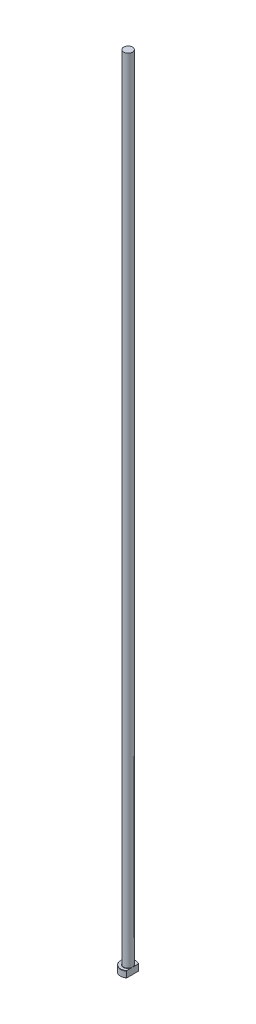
from build123d import *
from build123d.topology import SkipClean

# Parameters (mm, degrees)
CHAMFER1_SIZE = 0.2
FILLET1_R     = 0.2
KEY_DEPTH     = 631.057140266


with BuildPart() as part:
    # Sketch1 → Revolve1 (revolve)
    with BuildSketch(Plane.XY, mode=Mode.PRIVATE) as revolve1_sk:
        Polygon((0, 0), (-6, 0), (-6, 5), (-3.5, 5), (-3.5, 630), (0, 630), align=None)
    revolve(revolve1_sk.sketch.rotate(Axis((0, 259.958771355, 0), (0, -1, 0)), 270), axis=Axis((0, 259.958771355, 0), (0, -1, 0)))

    # Chamfer1
    chamfer1_edges = [part.edges().sort_by_distance(p)[0] for p in [
        (0, 5, -6),
        (0, 0, -6),
    ]]
    chamfer(chamfer1_edges, length=CHAMFER1_SIZE)

    # Fillet1
    fillet1_edges = [part.edges().sort_by_distance(p)[0] for p in [
        (0, 5, -3.5),
    ]]
    fillet(fillet1_edges, radius=FILLET1_R)

    # Sketch2 → KEY (cut, through all)
    with SkipClean():  # the faces are left unmerged after this step: merging them gives an invalid solid
        with BuildSketch(Plane(origin=(0, 0, 0), x_dir=(1, 0, 0), z_dir=(0, 1, 0))):
            with BuildLine():
                Line((3.5, 4.873397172), (3.5, -4.873397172))
                ThreePointArc((3.5, -4.873397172), (6, 0), (3.5, 4.873397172))
            make_face()
        extrude(amount=KEY_DEPTH, mode=Mode.SUBTRACT)


solid = part.part
